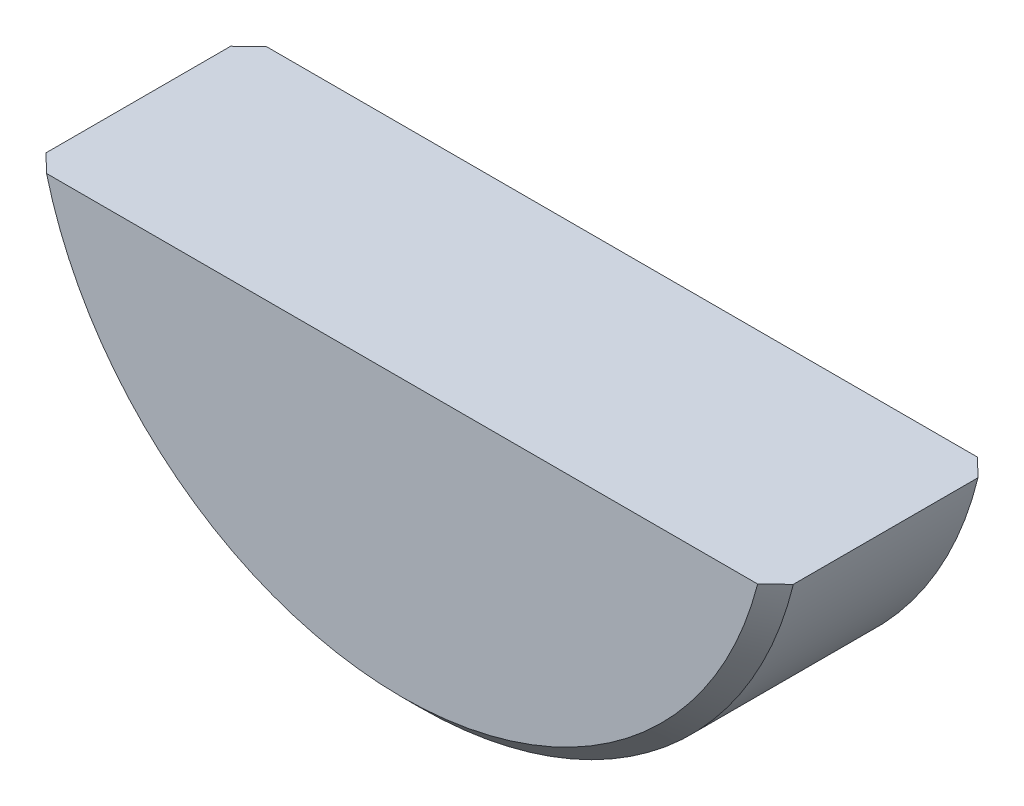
from build123d import *

# Parameters (mm, degrees)
BASEKEY_DEPTH = 1
CHAMFER1_SIZE = 0.16


with BuildPart() as part:
    # Sketch1 → BaseKey (new, symmetric)
    with BuildSketch(Plane.XY):
        with BuildLine():
            Line((-3.4, -0.830662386), (3.4, -0.830662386))
            ThreePointArc((3.4, -0.830662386), (0, -3.5), (-3.4, -0.830662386))
        make_face()
    extrude(amount=BASEKEY_DEPTH, both=True)

    # Chamfer1
    chamfer1_edges = [part.edges().sort_by_distance(p)[0] for p in [
        (0, -3.5, -1),
        (0, -3.5, 1),
    ]]
    chamfer(chamfer1_edges, length=CHAMFER1_SIZE)


solid = part.part
